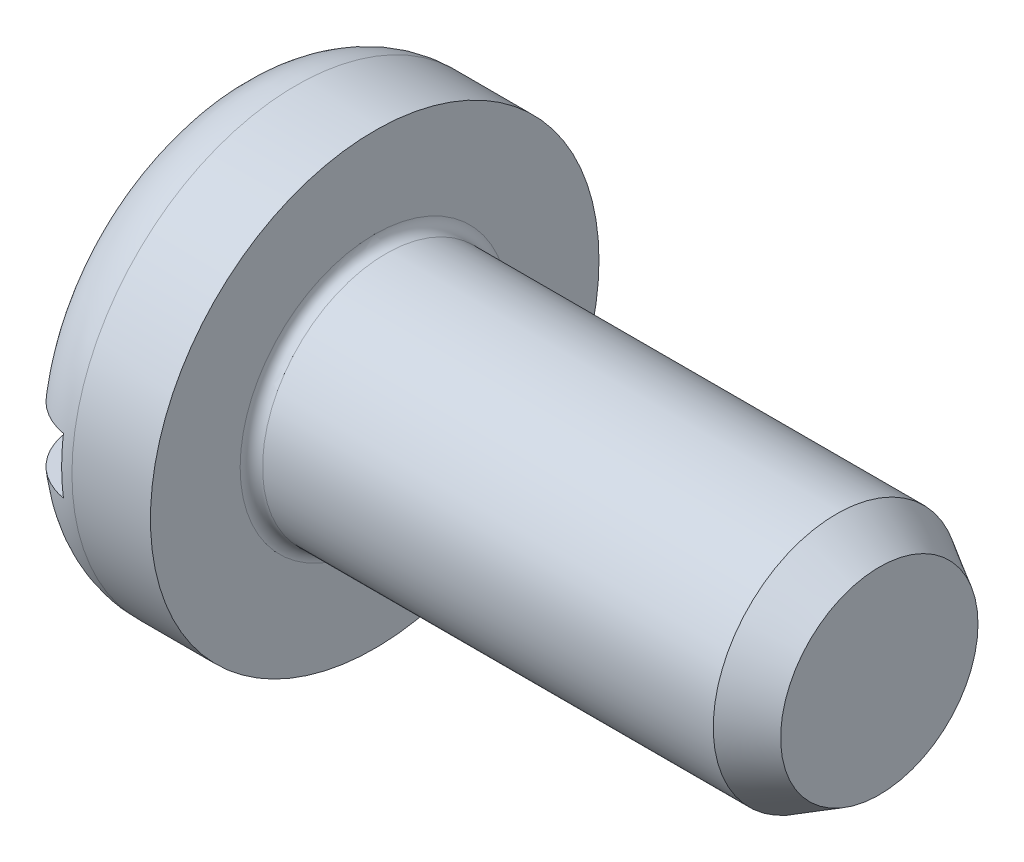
ISO-10303-21;
HEADER;
FILE_DESCRIPTION(('STEP AP214'),'2;1');
FILE_NAME('part.step','',(''),(''),'','','');
FILE_SCHEMA(('AUTOMOTIVE_DESIGN { 1 0 10303 214 1 1 1 1 }'));
ENDSEC;
DATA;
#1=APPLICATION_CONTEXT('core data for automotive mechanical design processes');
#2=APPLICATION_PROTOCOL_DEFINITION('international standard','automotive_design',2000,#1);
#3=PRODUCT_CONTEXT('',#1,'mechanical');
#4=PRODUCT('Part','Part','',(#3));
#5=PRODUCT_RELATED_PRODUCT_CATEGORY('part','',(#4));
#6=PRODUCT_DEFINITION_FORMATION('','',#4);
#7=PRODUCT_DEFINITION_CONTEXT('part definition',#1,'design');
#8=PRODUCT_DEFINITION('design','',#6,#7);
#9=PRODUCT_DEFINITION_SHAPE('','',#8);
#10=(LENGTH_UNIT() NAMED_UNIT(*) SI_UNIT(.MILLI.,.METRE.));
#11=(NAMED_UNIT(*) PLANE_ANGLE_UNIT() SI_UNIT($,.RADIAN.));
#12=(NAMED_UNIT(*) SI_UNIT($,.STERADIAN.) SOLID_ANGLE_UNIT());
#13=UNCERTAINTY_MEASURE_WITH_UNIT(LENGTH_MEASURE(1.E-05),#10,'distance_accuracy_value','');
#14=(GEOMETRIC_REPRESENTATION_CONTEXT(3) GLOBAL_UNCERTAINTY_ASSIGNED_CONTEXT((#13)) GLOBAL_UNIT_ASSIGNED_CONTEXT((#10,
#11,#12)) REPRESENTATION_CONTEXT('',''));
#15=CARTESIAN_POINT('',(0.,0.,0.));
#16=DIRECTION('',(0.,0.,1.));
#17=DIRECTION('',(1.,0.,0.));
#18=AXIS2_PLACEMENT_3D('',#15,#16,#17);
#19=CARTESIAN_POINT('',(0.,0.,0.));
#20=DIRECTION('',(-1.,0.,0.));
#21=DIRECTION('',(0.,0.,1.));
#22=AXIS2_PLACEMENT_3D('',#19,#20,#21);
#23=PLANE('',#22);
#24=DIRECTION('',(0.,0.,-1.));
#25=VECTOR('',#24,1.);
#26=CARTESIAN_POINT('',(0.,0.25,0.));
#27=LINE('',#26,#25);
#28=CARTESIAN_POINT('',(0.,0.25,1.37749773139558));
#29=VERTEX_POINT('',#28);
#30=CARTESIAN_POINT('',(0.,0.25,-1.37749773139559));
#31=VERTEX_POINT('',#30);
#32=EDGE_CURVE('E60',#29,#31,#27,.T.);
#33=ORIENTED_EDGE('',*,*,#32,.F.);
#34=CARTESIAN_POINT('',(0.,0.,0.));
#35=DIRECTION('',(-1.,0.,0.));
#36=DIRECTION('',(0.,0.,1.));
#37=AXIS2_PLACEMENT_3D('',#34,#35,#36);
#38=CIRCLE('',#37,1.4);
#39=EDGE_CURVE('E115',#29,#31,#38,.T.);
#40=ORIENTED_EDGE('',*,*,#39,.T.);
#41=EDGE_LOOP('',(#33,#40));
#42=FACE_BOUND('',#41,.T.);
#43=ADVANCED_FACE('F34',(#42),#23,.T.);
#44=CARTESIAN_POINT('',(5.8,1.1,0.));
#45=DIRECTION('',(1.,0.,0.));
#46=DIRECTION('',(0.,0.,-1.));
#47=AXIS2_PLACEMENT_3D('',#44,#45,#46);
#48=PLANE('',#47);
#49=CARTESIAN_POINT('',(5.8,0.,0.));
#50=DIRECTION('',(1.,0.,0.));
#51=DIRECTION('',(0.,0.,-1.));
#52=AXIS2_PLACEMENT_3D('',#49,#50,#51);
#53=CIRCLE('',#52,0.879999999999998);
#54=CARTESIAN_POINT('',(5.8,0.,-0.879999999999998));
#55=VERTEX_POINT('',#54);
#56=EDGE_CURVE('E138',#55,#55,#53,.T.);
#57=ORIENTED_EDGE('',*,*,#56,.T.);
#58=EDGE_LOOP('',(#57));
#59=FACE_BOUND('',#58,.T.);
#60=ADVANCED_FACE('F160',(#59),#48,.T.);
#61=CARTESIAN_POINT('',(13.1078858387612,0.,0.));
#62=DIRECTION('',(1.,0.,0.));
#63=DIRECTION('',(0.,0.,-1.));
#64=AXIS2_PLACEMENT_3D('',#61,#62,#63);
#65=CYLINDRICAL_SURFACE('',#64,1.1);
#66=CARTESIAN_POINT('',(1.4,0.,0.));
#67=DIRECTION('',(1.,0.,0.));
#68=DIRECTION('',(0.,0.,-1.));
#69=AXIS2_PLACEMENT_3D('',#66,#67,#68);
#70=CIRCLE('',#69,1.1);
#71=CARTESIAN_POINT('',(1.4,0.,-1.1));
#72=VERTEX_POINT('',#71);
#73=EDGE_CURVE('E130',#72,#72,#70,.T.);
#74=ORIENTED_EDGE('',*,*,#73,.T.);
#75=EDGE_LOOP('',(#74));
#76=FACE_BOUND('',#75,.T.);
#77=CARTESIAN_POINT('',(5.41894882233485,0.,0.));
#78=DIRECTION('',(1.,0.,0.));
#79=DIRECTION('',(0.,0.,-1.));
#80=AXIS2_PLACEMENT_3D('',#77,#78,#79);
#81=CIRCLE('',#80,1.1);
#82=CARTESIAN_POINT('',(5.41894882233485,0.,-1.1));
#83=VERTEX_POINT('',#82);
#84=EDGE_CURVE('E135',#83,#83,#81,.F.);
#85=ORIENTED_EDGE('',*,*,#84,.T.);
#86=EDGE_LOOP('',(#85));
#87=FACE_BOUND('',#86,.T.);
#88=ADVANCED_FACE('F156',(#76,#87),#65,.T.);
#89=CARTESIAN_POINT('',(1.3,2.,0.));
#90=DIRECTION('',(1.,0.,0.));
#91=DIRECTION('',(0.,0.,-1.));
#92=AXIS2_PLACEMENT_3D('',#89,#90,#91);
#93=PLANE('',#92);
#94=CARTESIAN_POINT('',(1.3,0.,0.));
#95=DIRECTION('',(1.,0.,0.));
#96=DIRECTION('',(0.,0.,-1.));
#97=AXIS2_PLACEMENT_3D('',#94,#95,#96);
#98=CIRCLE('',#97,1.2);
#99=CARTESIAN_POINT('',(1.3,0.,-1.2));
#100=VERTEX_POINT('',#99);
#101=EDGE_CURVE('E126',#100,#100,#98,.F.);
#102=ORIENTED_EDGE('',*,*,#101,.T.);
#103=EDGE_LOOP('',(#102));
#104=FACE_BOUND('',#103,.T.);
#105=CARTESIAN_POINT('',(1.3,0.,0.));
#106=DIRECTION('',(1.,0.,0.));
#107=DIRECTION('',(0.,0.,-1.));
#108=AXIS2_PLACEMENT_3D('',#105,#106,#107);
#109=CIRCLE('',#108,2.);
#110=CARTESIAN_POINT('',(1.3,0.,-2.));
#111=VERTEX_POINT('',#110);
#112=EDGE_CURVE('E141',#111,#111,#109,.T.);
#113=ORIENTED_EDGE('',*,*,#112,.T.);
#114=EDGE_LOOP('',(#113));
#115=FACE_BOUND('',#114,.T.);
#116=ADVANCED_FACE('F147',(#104,#115),#93,.T.);
#117=CARTESIAN_POINT('',(13.1078858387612,0.,0.));
#118=DIRECTION('',(1.,0.,0.));
#119=DIRECTION('',(0.,0.,-1.));
#120=AXIS2_PLACEMENT_3D('',#117,#118,#119);
#121=CYLINDRICAL_SURFACE('',#120,2.);
#122=CARTESIAN_POINT('',(0.6,0.,0.));
#123=DIRECTION('',(-1.,0.,0.));
#124=DIRECTION('',(0.,0.,1.));
#125=AXIS2_PLACEMENT_3D('',#122,#123,#124);
#126=CIRCLE('',#125,2.);
#127=CARTESIAN_POINT('',(0.6,0.,2.));
#128=VERTEX_POINT('',#127);
#129=EDGE_CURVE('E123',#128,#128,#126,.F.);
#130=ORIENTED_EDGE('',*,*,#129,.T.);
#131=EDGE_LOOP('',(#130));
#132=FACE_BOUND('',#131,.T.);
#133=ORIENTED_EDGE('',*,*,#112,.F.);
#134=EDGE_LOOP('',(#133));
#135=FACE_BOUND('',#134,.T.);
#136=ADVANCED_FACE('F149',(#132,#135),#121,.T.);
#137=DIRECTION('',(0.,0.,1.));
#138=VECTOR('',#137,1.);
#139=CARTESIAN_POINT('',(0.,-0.25,0.));
#140=LINE('',#139,#138);
#141=CARTESIAN_POINT('',(0.,-0.25,-1.37749773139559));
#142=VERTEX_POINT('',#141);
#143=CARTESIAN_POINT('',(0.,-0.25,1.37749773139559));
#144=VERTEX_POINT('',#143);
#145=EDGE_CURVE('E53',#142,#144,#140,.T.);
#146=ORIENTED_EDGE('',*,*,#145,.F.);
#147=EDGE_CURVE('E96',#142,#144,#38,.T.);
#148=ORIENTED_EDGE('',*,*,#147,.T.);
#149=EDGE_LOOP('',(#146,#148));
#150=FACE_BOUND('',#149,.T.);
#151=ADVANCED_FACE('F108',(#150),#23,.T.);
#152=CARTESIAN_POINT('',(5.8,0.,0.));
#153=DIRECTION('',(-1.,0.,0.));
#154=DIRECTION('',(0.,0.,1.));
#155=AXIS2_PLACEMENT_3D('',#152,#153,#154);
#156=CONICAL_SURFACE('',#155,0.879999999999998,0.523598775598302);
#157=ORIENTED_EDGE('',*,*,#84,.F.);
#158=EDGE_LOOP('',(#157));
#159=FACE_BOUND('',#158,.T.);
#160=ORIENTED_EDGE('',*,*,#56,.F.);
#161=EDGE_LOOP('',(#160));
#162=FACE_BOUND('',#161,.T.);
#163=ADVANCED_FACE('F155',(#159,#162),#156,.T.);
#164=CARTESIAN_POINT('',(1.4,0.,0.));
#165=DIRECTION('',(1.,0.,0.));
#166=DIRECTION('',(0.,0.,-1.));
#167=AXIS2_PLACEMENT_3D('',#164,#165,#166);
#168=TOROIDAL_SURFACE('',#167,1.2,0.1);
#169=ORIENTED_EDGE('',*,*,#101,.F.);
#170=EDGE_LOOP('',(#169));
#171=FACE_BOUND('',#170,.T.);
#172=ORIENTED_EDGE('',*,*,#73,.F.);
#173=EDGE_LOOP('',(#172));
#174=FACE_BOUND('',#173,.T.);
#175=ADVANCED_FACE('F173',(#171,#174),#168,.F.);
#176=CARTESIAN_POINT('',(0.6,0.,0.));
#177=DIRECTION('',(-1.,0.,0.));
#178=DIRECTION('',(0.,0.,1.));
#179=AXIS2_PLACEMENT_3D('',#176,#177,#178);
#180=TOROIDAL_SURFACE('',#179,1.4,0.6);
#181=CARTESIAN_POINT('',(0.274446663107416,0.25,-1.88751485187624));
#182=CARTESIAN_POINT('',(0.302521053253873,0.25,-1.9058058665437));
#183=CARTESIAN_POINT('',(0.33215460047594,0.25,-1.92174699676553));
#184=CARTESIAN_POINT('',(0.393700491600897,0.25,-1.94844353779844));
#185=CARTESIAN_POINT('',(0.425615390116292,0.25,-1.95919302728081));
#186=CARTESIAN_POINT('',(0.490790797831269,0.25,-1.97517084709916));
#187=CARTESIAN_POINT('',(0.524050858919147,0.25,-1.98040100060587));
#188=CARTESIAN_POINT('',(0.590968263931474,0.25,-1.98518928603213));
#189=CARTESIAN_POINT('',(0.6246255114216,0.25,-1.98474876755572));
#190=CARTESIAN_POINT('',(0.691325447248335,0.25,-1.9782186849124));
#191=CARTESIAN_POINT('',(0.7243691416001,0.25,-1.97213939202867));
#192=CARTESIAN_POINT('',(0.788969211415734,0.25,-1.95452411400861));
#193=CARTESIAN_POINT('',(0.820525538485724,0.25,-1.94298795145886));
#194=CARTESIAN_POINT('',(0.881288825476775,0.25,-1.91478263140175));
#195=CARTESIAN_POINT('',(0.910493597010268,0.25,-1.89810876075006));
#196=CARTESIAN_POINT('',(0.9657060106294,0.25,-1.86011629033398));
#197=CARTESIAN_POINT('',(0.991713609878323,0.25,-1.83879762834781));
#198=CARTESIAN_POINT('',(1.03993069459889,0.25,-1.79201907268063));
#199=CARTESIAN_POINT('',(1.06212166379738,0.25,-1.76654009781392));
#200=CARTESIAN_POINT('',(1.10195361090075,0.25,-1.7122455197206));
#201=CARTESIAN_POINT('',(1.1195944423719,0.25,-1.68342980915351));
#202=CARTESIAN_POINT('',(1.14999499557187,0.25,-1.6230180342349));
#203=CARTESIAN_POINT('',(1.16271134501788,0.25,-1.59140015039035));
#204=CARTESIAN_POINT('',(1.18272657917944,0.25,-1.52649488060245));
#205=CARTESIAN_POINT('',(1.19002515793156,0.25,-1.49320740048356));
#206=CARTESIAN_POINT('',(1.19909884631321,0.25,-1.42547106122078));
#207=CARTESIAN_POINT('',(1.20080483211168,0.25,-1.39101294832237));
#208=CARTESIAN_POINT('',(1.19849411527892,0.25,-1.32228972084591));
#209=CARTESIAN_POINT('',(1.19447696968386,0.25,-1.28802462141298));
#210=CARTESIAN_POINT('',(1.18076791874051,0.25,-1.22013715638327));
#211=CARTESIAN_POINT('',(1.17099548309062,0.25,-1.18653104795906));
#212=CARTESIAN_POINT('',(1.14600810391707,0.25,-1.12140538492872));
#213=CARTESIAN_POINT('',(1.13079264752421,0.25,-1.08988602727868));
#214=CARTESIAN_POINT('',(1.09515290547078,0.25,-1.02948947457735));
#215=CARTESIAN_POINT('',(1.07467518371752,0.25,-1.00064378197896));
#216=CARTESIAN_POINT('',(1.02914168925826,0.25,-0.946817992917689));
#217=CARTESIAN_POINT('',(1.00408565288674,0.25,-0.921838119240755));
#218=CARTESIAN_POINT('',(0.950223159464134,0.25,-0.876669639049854));
#219=CARTESIAN_POINT('',(0.921439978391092,0.25,-0.85645332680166));
#220=CARTESIAN_POINT('',(0.860791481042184,0.25,-0.821340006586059));
#221=CARTESIAN_POINT('',(0.828926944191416,0.25,-0.806441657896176));
#222=CARTESIAN_POINT('',(0.764188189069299,0.25,-0.782986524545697));
#223=CARTESIAN_POINT('',(0.731387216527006,0.25,-0.774227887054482));
#224=CARTESIAN_POINT('',(0.664759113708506,0.25,-0.762621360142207));
#225=CARTESIAN_POINT('',(0.630932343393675,0.25,-0.759771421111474));
#226=CARTESIAN_POINT('',(0.564762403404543,0.25,-0.760104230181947));
#227=CARTESIAN_POINT('',(0.532417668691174,0.25,-0.763034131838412));
#228=CARTESIAN_POINT('',(0.468685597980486,0.25,-0.774297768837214));
#229=CARTESIAN_POINT('',(0.437298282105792,0.25,-0.782631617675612));
#230=CARTESIAN_POINT('',(0.37639068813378,0.25,-0.80434783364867));
#231=CARTESIAN_POINT('',(0.346867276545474,0.25,-0.817721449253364));
#232=CARTESIAN_POINT('',(0.290360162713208,0.25,-0.84904601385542));
#233=CARTESIAN_POINT('',(0.263376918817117,0.25,-0.866997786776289));
#234=CARTESIAN_POINT('',(0.211549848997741,0.25,-0.907739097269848));
#235=CARTESIAN_POINT('',(0.186836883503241,0.25,-0.930695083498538));
#236=CARTESIAN_POINT('',(0.141440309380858,0.25,-0.980295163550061));
#237=CARTESIAN_POINT('',(0.120757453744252,0.25,-1.00693994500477));
#238=CARTESIAN_POINT('',(0.0832351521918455,0.25,-1.06425685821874));
#239=CARTESIAN_POINT('',(0.0665688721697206,0.25,-1.09504252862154));
#240=CARTESIAN_POINT('',(0.0385748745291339,0.25,-1.15895379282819));
#241=CARTESIAN_POINT('',(0.0272475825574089,0.25,-1.19207957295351));
#242=CARTESIAN_POINT('',(0.0101728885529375,0.25,-1.2601285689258));
#243=CARTESIAN_POINT('',(0.00448792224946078,0.25,-1.29506749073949));
#244=CARTESIAN_POINT('',(-0.000882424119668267,0.25,-1.36540339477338));
#245=CARTESIAN_POINT('',(-0.000568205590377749,0.25,-1.40080034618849));
#246=CARTESIAN_POINT('',(0.00606540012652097,0.25,-1.47072452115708));
#247=CARTESIAN_POINT('',(0.0123337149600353,0.25,-1.50525658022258));
#248=CARTESIAN_POINT('',(0.0306671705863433,0.25,-1.57275717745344));
#249=CARTESIAN_POINT('',(0.042733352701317,0.25,-1.60572543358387));
#250=CARTESIAN_POINT('',(0.0721364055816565,0.25,-1.66865972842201));
#251=CARTESIAN_POINT('',(0.0893977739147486,0.25,-1.69866109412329));
#252=CARTESIAN_POINT('',(0.128764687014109,0.25,-1.75525974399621));
#253=CARTESIAN_POINT('',(0.150863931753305,0.25,-1.78186138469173));
#254=CARTESIAN_POINT('',(0.190112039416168,0.25,-1.82161520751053));
#255=CARTESIAN_POINT('',(0.205980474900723,0.25,-1.83605370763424));
#256=CARTESIAN_POINT('',(0.239168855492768,0.25,-1.86315357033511));
#257=CARTESIAN_POINT('',(0.256488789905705,0.25,-1.87581494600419));
#258=CARTESIAN_POINT('',(0.274446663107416,0.25,-1.88751485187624));
#259=B_SPLINE_CURVE_WITH_KNOTS('',3,(#181,#182,#183,#184,#185,#186,#187,#188,#189,#190,#191,
#192,#193,#194,#195,#196,#197,#198,#199,#200,#201,#202,#203,#204,#205,#206,#207,#208,#209,#210,
#211,#212,#213,#214,#215,#216,#217,#218,#219,#220,#221,#222,#223,#224,#225,#226,#227,#228,#229,
#230,#231,#232,#233,#234,#235,#236,#237,#238,#239,#240,#241,#242,#243,#244,#245,#246,#247,#248,
#249,#250,#251,#252,#253,#254,#255,#256,#257,#258),.UNSPECIFIED.,.T.,.F.,(4,2,2,2,2,2,2,2,2,2,2,
2,2,2,2,2,2,2,2,2,2,2,2,2,2,2,2,2,2,2,2,2,2,2,2,2,2,2,4),(0.,0.10044373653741,0.201001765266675,
0.301526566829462,0.402027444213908,0.502345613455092,0.602667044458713,0.703080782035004,
0.8034958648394,0.904385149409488,1.00527768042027,1.10703963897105,1.20880734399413,
1.31182823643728,1.41485710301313,1.51936303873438,1.6238788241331,1.72950102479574,
1.83512931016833,1.9401271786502,2.04509855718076,2.14643257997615,2.24773144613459,
2.34469702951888,2.44166464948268,2.53846465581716,2.63528209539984,2.73601962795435,
2.836775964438,2.94130978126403,3.04585193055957,3.15153841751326,3.25721783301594,
3.3619988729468,3.4667987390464,3.57014359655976,3.67335466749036,3.73760429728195,
3.80185345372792),.UNSPECIFIED.);
#260=CARTESIAN_POINT('',(0.5,0.25,-1.97585483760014));
#261=VERTEX_POINT('',#260);
#262=EDGE_CURVE('E11',#31,#261,#259,.T.);
#263=ORIENTED_EDGE('',*,*,#262,.F.);
#264=ORIENTED_EDGE('',*,*,#39,.F.);
#265=CARTESIAN_POINT('',(0.274188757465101,0.25,0.860590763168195));
#266=CARTESIAN_POINT('',(0.301474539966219,0.25,0.8422177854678));
#267=CARTESIAN_POINT('',(0.330273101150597,0.25,0.826059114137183));
#268=CARTESIAN_POINT('',(0.390172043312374,0.25,0.798735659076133));
#269=CARTESIAN_POINT('',(0.421273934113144,0.25,0.787574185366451));
#270=CARTESIAN_POINT('',(0.484970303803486,0.25,0.770683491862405));
#271=CARTESIAN_POINT('',(0.517566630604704,0.25,0.764961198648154));
#272=CARTESIAN_POINT('',(0.583250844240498,0.25,0.759228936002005));
#273=CARTESIAN_POINT('',(0.616338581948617,0.25,0.759217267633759));
#274=CARTESIAN_POINT('',(0.681233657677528,0.25,0.764833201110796));
#275=CARTESIAN_POINT('',(0.713052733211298,0.25,0.770326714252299));
#276=CARTESIAN_POINT('',(0.775335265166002,0.25,0.786521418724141));
#277=CARTESIAN_POINT('',(0.805798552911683,0.25,0.797223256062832));
#278=CARTESIAN_POINT('',(0.864902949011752,0.25,0.823576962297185));
#279=CARTESIAN_POINT('',(0.89352008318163,0.25,0.83928244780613));
#280=CARTESIAN_POINT('',(0.947863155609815,0.25,0.875079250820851));
#281=CARTESIAN_POINT('',(0.973588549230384,0.25,0.895171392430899));
#282=CARTESIAN_POINT('',(1.02260785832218,0.25,0.940122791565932));
#283=CARTESIAN_POINT('',(1.04574542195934,0.25,0.965152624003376));
#284=CARTESIAN_POINT('',(1.08765047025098,0.25,1.01863696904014));
#285=CARTESIAN_POINT('',(1.10641722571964,0.25,1.04709205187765));
#286=CARTESIAN_POINT('',(1.13962700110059,0.25,1.10761472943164));
#287=CARTESIAN_POINT('',(1.15391313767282,0.25,1.13976856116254));
#288=CARTESIAN_POINT('',(1.17691746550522,0.25,1.206011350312));
#289=CARTESIAN_POINT('',(1.18563538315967,0.25,1.24010040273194));
#290=CARTESIAN_POINT('',(1.19725856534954,0.25,1.30943782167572));
#291=CARTESIAN_POINT('',(1.20013386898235,0.25,1.34469122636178));
#292=CARTESIAN_POINT('',(1.19985655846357,0.25,1.41517552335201));
#293=CARTESIAN_POINT('',(1.19670421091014,0.25,1.45040641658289));
#294=CARTESIAN_POINT('',(1.18448589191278,0.25,1.51943456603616));
#295=CARTESIAN_POINT('',(1.17548437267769,0.25,1.55324322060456));
#296=CARTESIAN_POINT('',(1.15184957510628,0.25,1.6188319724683));
#297=CARTESIAN_POINT('',(1.1372167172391,0.25,1.65061222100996));
#298=CARTESIAN_POINT('',(1.10296526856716,0.25,1.71075309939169));
#299=CARTESIAN_POINT('',(1.08342180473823,0.25,1.73915651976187));
#300=CARTESIAN_POINT('',(1.03978895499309,0.25,1.79222635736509));
#301=CARTESIAN_POINT('',(1.01569987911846,0.25,1.81689302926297));
#302=CARTESIAN_POINT('',(0.96397994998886,0.25,1.86147494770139));
#303=CARTESIAN_POINT('',(0.936395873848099,0.25,1.88144447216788));
#304=CARTESIAN_POINT('',(0.878243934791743,0.25,1.91642327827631));
#305=CARTESIAN_POINT('',(0.847676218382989,0.25,1.93143280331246));
#306=CARTESIAN_POINT('',(0.784699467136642,0.25,1.95594147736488));
#307=CARTESIAN_POINT('',(0.752307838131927,0.25,1.96548536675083));
#308=CARTESIAN_POINT('',(0.686379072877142,0.25,1.97897323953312));
#309=CARTESIAN_POINT('',(0.652841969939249,0.25,1.98291738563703));
#310=CARTESIAN_POINT('',(0.585728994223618,0.25,1.98508464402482));
#311=CARTESIAN_POINT('',(0.552153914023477,0.25,1.9833323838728));
#312=CARTESIAN_POINT('',(0.485775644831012,0.25,1.97421254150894));
#313=CARTESIAN_POINT('',(0.452972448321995,0.25,1.96684501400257));
#314=CARTESIAN_POINT('',(0.38908394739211,0.25,1.94671576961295));
#315=CARTESIAN_POINT('',(0.357997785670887,0.25,1.93395677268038));
#316=CARTESIAN_POINT('',(0.298399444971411,0.25,1.9034171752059));
#317=CARTESIAN_POINT('',(0.269887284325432,0.25,1.88563653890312));
#318=CARTESIAN_POINT('',(0.216141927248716,0.25,1.84550317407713));
#319=CARTESIAN_POINT('',(0.190919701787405,0.25,1.82313575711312));
#320=CARTESIAN_POINT('',(0.144556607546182,0.25,1.77451068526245));
#321=CARTESIAN_POINT('',(0.123415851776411,0.25,1.74825292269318));
#322=CARTESIAN_POINT('',(0.0856483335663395,0.25,1.69239770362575));
#323=CARTESIAN_POINT('',(0.0690547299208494,0.25,1.66277783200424));
#324=CARTESIAN_POINT('',(0.0410151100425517,0.25,1.60119541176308));
#325=CARTESIAN_POINT('',(0.0295693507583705,0.25,1.56923274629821));
#326=CARTESIAN_POINT('',(0.0120095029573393,0.25,1.50349888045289));
#327=CARTESIAN_POINT('',(0.00595539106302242,0.25,1.46971166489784));
#328=CARTESIAN_POINT('',(-0.000477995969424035,0.25,1.40160338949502));
#329=CARTESIAN_POINT('',(-0.000857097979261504,0.25,1.36728231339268));
#330=CARTESIAN_POINT('',(0.00406316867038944,0.25,1.29857235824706));
#331=CARTESIAN_POINT('',(0.0094412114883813,0.25,1.2641891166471));
#332=CARTESIAN_POINT('',(0.0258177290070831,0.25,1.19677853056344));
#333=CARTESIAN_POINT('',(0.0368180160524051,0.25,1.16375162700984));
#334=CARTESIAN_POINT('',(0.064301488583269,0.25,1.09953382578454));
#335=CARTESIAN_POINT('',(0.0808570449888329,0.25,1.06837392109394));
#336=CARTESIAN_POINT('',(0.118941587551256,0.25,1.00928774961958));
#337=CARTESIAN_POINT('',(0.140465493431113,0.25,0.981358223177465));
#338=CARTESIAN_POINT('',(0.180564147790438,0.25,0.937550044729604));
#339=CARTESIAN_POINT('',(0.197997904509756,0.25,0.920612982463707));
#340=CARTESIAN_POINT('',(0.234742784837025,0.25,0.888912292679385));
#341=CARTESIAN_POINT('',(0.254053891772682,0.25,0.874148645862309));
#342=CARTESIAN_POINT('',(0.274188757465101,0.25,0.860590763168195));
#343=B_SPLINE_CURVE_WITH_KNOTS('',3,(#265,#266,#267,#268,#269,#270,#271,#272,#273,#274,#275,
#276,#277,#278,#279,#280,#281,#282,#283,#284,#285,#286,#287,#288,#289,#290,#291,#292,#293,#294,
#295,#296,#297,#298,#299,#300,#301,#302,#303,#304,#305,#306,#307,#308,#309,#310,#311,#312,#313,
#314,#315,#316,#317,#318,#319,#320,#321,#322,#323,#324,#325,#326,#327,#328,#329,#330,#331,#332,
#333,#334,#335,#336,#337,#338,#339,#340,#341,#342),.UNSPECIFIED.,.T.,.F.,(4,2,2,2,2,2,2,2,2,2,2,
2,2,2,2,2,2,2,2,2,2,2,2,2,2,2,2,2,2,2,2,2,2,2,2,2,2,2,4),(0.,0.0986016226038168,
0.197268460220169,0.296060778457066,0.394823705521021,0.491238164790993,0.587664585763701,
0.685161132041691,0.782676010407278,0.884472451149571,0.986285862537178,1.09134452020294,
1.19640833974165,1.30200958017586,1.40760615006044,1.5120584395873,1.61650293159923,
1.71943766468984,1.82236537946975,1.92403782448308,2.02570527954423,2.12652815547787,
2.22734810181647,2.32773274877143,2.42811641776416,2.52844950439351,2.62878330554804,
2.72944357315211,2.83010662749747,2.93148530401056,3.03286904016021,3.13536696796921,
3.23786802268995,3.34178789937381,3.44574129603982,3.5511052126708,3.65636186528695,
3.72912313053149,3.80188374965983),.UNSPECIFIED.);
#344=CARTESIAN_POINT('',(0.5,0.25,1.97585483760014));
#345=VERTEX_POINT('',#344);
#346=EDGE_CURVE('E97',#345,#29,#343,.T.);
#347=ORIENTED_EDGE('',*,*,#346,.F.);
#348=CARTESIAN_POINT('',(0.5,0.,0.));
#349=DIRECTION('',(1.,0.,0.));
#350=DIRECTION('',(0.,1.,0.));
#351=AXIS2_PLACEMENT_3D('',#348,#349,#350);
#352=CIRCLE('',#351,1.99160797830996);
#353=CARTESIAN_POINT('',(0.5,-0.25,1.97585483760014));
#354=VERTEX_POINT('',#353);
#355=EDGE_CURVE('E89',#354,#345,#352,.F.);
#356=ORIENTED_EDGE('',*,*,#355,.F.);
#357=CARTESIAN_POINT('',(0.274188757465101,-0.25,0.860590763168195));
#358=CARTESIAN_POINT('',(0.245293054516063,-0.25,0.880050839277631));
#359=CARTESIAN_POINT('',(0.218052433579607,-0.25,0.902023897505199));
#360=CARTESIAN_POINT('',(0.167631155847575,-0.25,0.95026556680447));
#361=CARTESIAN_POINT('',(0.144457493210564,-0.25,0.9765414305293));
#362=CARTESIAN_POINT('',(0.102838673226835,-0.25,1.03254910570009));
#363=CARTESIAN_POINT('',(0.0843869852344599,-0.25,1.06227606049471));
#364=CARTESIAN_POINT('',(0.0526746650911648,-0.25,1.1243649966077));
#365=CARTESIAN_POINT('',(0.0394121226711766,-0.25,1.15672600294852));
#366=CARTESIAN_POINT('',(0.018320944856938,-0.25,1.22359548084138));
#367=CARTESIAN_POINT('',(0.0105581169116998,-0.25,1.25812474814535));
#368=CARTESIAN_POINT('',(0.000976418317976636,-0.25,1.32800242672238));
#369=CARTESIAN_POINT('',(-0.000842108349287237,-0.25,1.3633508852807));
#370=CARTESIAN_POINT('',(0.00155370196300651,-0.25,1.43362976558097));
#371=CARTESIAN_POINT('',(0.00573151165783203,-0.25,1.46856142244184));
#372=CARTESIAN_POINT('',(0.0199781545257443,-0.25,1.53720281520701));
#373=CARTESIAN_POINT('',(0.0300465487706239,-0.25,1.57091264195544));
#374=CARTESIAN_POINT('',(0.0556372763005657,-0.25,1.63564743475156));
#375=CARTESIAN_POINT('',(0.0710810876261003,-0.25,1.66670344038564));
#376=CARTESIAN_POINT('',(0.107032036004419,-0.25,1.72573226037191));
#377=CARTESIAN_POINT('',(0.127538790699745,-0.25,1.75370530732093));
#378=CARTESIAN_POINT('',(0.172731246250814,-0.25,1.80537649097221));
#379=CARTESIAN_POINT('',(0.19735684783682,-0.25,1.8291272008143));
#380=CARTESIAN_POINT('',(0.250280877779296,-0.25,1.87210643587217));
#381=CARTESIAN_POINT('',(0.278579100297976,-0.25,1.89133521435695));
#382=CARTESIAN_POINT('',(0.337738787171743,-0.25,1.92452859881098));
#383=CARTESIAN_POINT('',(0.368571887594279,-0.25,1.93854377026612));
#384=CARTESIAN_POINT('',(0.432162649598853,-0.25,1.96116348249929));
#385=CARTESIAN_POINT('',(0.464920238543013,-0.25,1.96976822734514));
#386=CARTESIAN_POINT('',(0.531220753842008,-0.25,1.98127744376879));
#387=CARTESIAN_POINT('',(0.564757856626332,-0.25,1.98421548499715));
#388=CARTESIAN_POINT('',(0.631847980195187,-0.25,1.98440664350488));
#389=CARTESIAN_POINT('',(0.665401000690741,-0.25,1.98165986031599));
#390=CARTESIAN_POINT('',(0.731498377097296,-0.25,1.97057388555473));
#391=CARTESIAN_POINT('',(0.764044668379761,-0.25,1.96224622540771));
#392=CARTESIAN_POINT('',(0.827280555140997,-0.25,1.94025394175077));
#393=CARTESIAN_POINT('',(0.857970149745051,-0.25,1.92658931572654));
#394=CARTESIAN_POINT('',(0.916681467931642,-0.25,1.89429343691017));
#395=CARTESIAN_POINT('',(0.944698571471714,-0.25,1.87565378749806));
#396=CARTESIAN_POINT('',(0.997227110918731,-0.25,1.83395925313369));
#397=CARTESIAN_POINT('',(1.02173848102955,-0.25,1.81090428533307));
#398=CARTESIAN_POINT('',(1.06671027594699,-0.25,1.76090348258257));
#399=CARTESIAN_POINT('',(1.08714765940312,-0.25,1.7339369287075));
#400=CARTESIAN_POINT('',(1.12325356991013,-0.25,1.67698194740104));
#401=CARTESIAN_POINT('',(1.13892191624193,-0.25,1.64699340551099));
#402=CARTESIAN_POINT('',(1.16520961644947,-0.25,1.58454738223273));
#403=CARTESIAN_POINT('',(1.17578008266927,-0.25,1.55206932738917));
#404=CARTESIAN_POINT('',(1.1913945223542,-0.25,1.48581189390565));
#405=CARTESIAN_POINT('',(1.19643816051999,-0.25,1.4520324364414));
#406=CARTESIAN_POINT('',(1.20092952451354,-0.25,1.38366471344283));
#407=CARTESIAN_POINT('',(1.20030396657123,-0.25,1.34907163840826));
#408=CARTESIAN_POINT('',(1.19333975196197,-0.25,1.28046580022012));
#409=CARTESIAN_POINT('',(1.18700063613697,-0.25,1.2464530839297));
#410=CARTESIAN_POINT('',(1.16868481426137,-0.25,1.17945927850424));
#411=CARTESIAN_POINT('',(1.15662911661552,-0.25,1.14649977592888));
#412=CARTESIAN_POINT('',(1.1272032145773,-0.25,1.08304257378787));
#413=CARTESIAN_POINT('',(1.10983248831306,-0.25,1.05254511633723));
#414=CARTESIAN_POINT('',(1.07008075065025,-0.25,0.99462499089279));
#415=CARTESIAN_POINT('',(1.04765845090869,-0.25,0.967230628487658));
#416=CARTESIAN_POINT('',(0.998485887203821,-0.25,0.916640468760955));
#417=CARTESIAN_POINT('',(0.971735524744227,-0.25,0.893444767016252));
#418=CARTESIAN_POINT('',(0.914946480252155,-0.25,0.852254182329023));
#419=CARTESIAN_POINT('',(0.884948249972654,-0.25,0.834203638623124));
#420=CARTESIAN_POINT('',(0.822255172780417,-0.25,0.803635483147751));
#421=CARTESIAN_POINT('',(0.78956131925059,-0.25,0.791115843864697));
#422=CARTESIAN_POINT('',(0.723789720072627,-0.25,0.772521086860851));
#423=CARTESIAN_POINT('',(0.690778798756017,-0.25,0.766209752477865));
#424=CARTESIAN_POINT('',(0.624155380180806,-0.25,0.75946523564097));
#425=CARTESIAN_POINT('',(0.590542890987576,-0.25,0.759031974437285));
#426=CARTESIAN_POINT('',(0.525027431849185,-0.25,0.763966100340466));
#427=CARTESIAN_POINT('',(0.493107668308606,-0.25,0.769116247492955));
#428=CARTESIAN_POINT('',(0.430600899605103,-0.25,0.784655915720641));
#429=CARTESIAN_POINT('',(0.400012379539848,-0.25,0.795039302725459));
#430=CARTESIAN_POINT('',(0.35367369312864,-0.25,0.815117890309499));
#431=CARTESIAN_POINT('',(0.33719914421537,-0.25,0.823188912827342));
#432=CARTESIAN_POINT('',(0.305059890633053,-0.25,0.840804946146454));
#433=CARTESIAN_POINT('',(0.289395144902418,-0.25,0.850349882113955));
#434=CARTESIAN_POINT('',(0.274188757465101,-0.25,0.860590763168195));
#435=B_SPLINE_CURVE_WITH_KNOTS('',3,(#357,#358,#359,#360,#361,#362,#363,#364,#365,#366,#367,
#368,#369,#370,#371,#372,#373,#374,#375,#376,#377,#378,#379,#380,#381,#382,#383,#384,#385,#386,
#387,#388,#389,#390,#391,#392,#393,#394,#395,#396,#397,#398,#399,#400,#401,#402,#403,#404,#405,
#406,#407,#408,#409,#410,#411,#412,#413,#414,#415,#416,#417,#418,#419,#420,#421,#422,#423,#424,
#425,#426,#427,#428,#429,#430,#431,#432,#433,#434),.UNSPECIFIED.,.T.,.F.,(4,2,2,2,2,2,2,2,2,2,2,
2,2,2,2,2,2,2,2,2,2,2,2,2,2,2,2,2,2,2,2,2,2,2,2,2,2,2,4),(0.,0.104443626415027,
0.209065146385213,0.313541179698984,0.417978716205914,0.523645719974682,0.629318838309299,
0.734350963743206,0.839375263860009,0.942925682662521,1.04646828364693,1.14861423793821,
1.25075446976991,1.35187650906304,1.45299473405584,1.55351207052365,1.65402764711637,
1.75433617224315,1.85464474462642,1.95512369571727,2.05560453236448,2.15663847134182,
2.25767623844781,2.35966456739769,2.46165908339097,2.56497390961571,2.6682970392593,
2.77309144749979,2.87789614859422,2.98359071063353,3.08928767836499,3.19379358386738,
3.29826114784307,3.3985794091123,3.49889632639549,3.59544570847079,3.691882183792,
3.74684851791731,3.80181206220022),.UNSPECIFIED.);
#436=EDGE_CURVE('E91',#144,#354,#435,.T.);
#437=ORIENTED_EDGE('',*,*,#436,.F.);
#438=ORIENTED_EDGE('',*,*,#147,.F.);
#439=CARTESIAN_POINT('',(0.274446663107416,-0.25,-1.88751485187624));
#440=CARTESIAN_POINT('',(0.246091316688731,-0.25,-1.86903712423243));
#441=CARTESIAN_POINT('',(0.219284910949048,-0.25,-1.84813447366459));
#442=CARTESIAN_POINT('',(0.169551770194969,-0.25,-1.80209585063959));
#443=CARTESIAN_POINT('',(0.146630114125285,-0.25,-1.77695442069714));
#444=CARTESIAN_POINT('',(0.105343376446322,-0.25,-1.72320735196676));
#445=CARTESIAN_POINT('',(0.0869742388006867,-0.25,-1.69460483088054));
#446=CARTESIAN_POINT('',(0.0552627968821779,-0.25,-1.63474965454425));
#447=CARTESIAN_POINT('',(0.0419192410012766,-0.25,-1.60349766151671));
#448=CARTESIAN_POINT('',(0.0205039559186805,-0.25,-1.53896682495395));
#449=CARTESIAN_POINT('',(0.0124741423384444,-0.25,-1.50567407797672));
#450=CARTESIAN_POINT('',(0.0020365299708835,-0.25,-1.43821821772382));
#451=CARTESIAN_POINT('',(-0.00037067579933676,-0.25,-1.40405501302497));
#452=CARTESIAN_POINT('',(0.000468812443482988,-0.25,-1.33533493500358));
#453=CARTESIAN_POINT('',(0.00379263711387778,-0.25,-1.30077900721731));
#454=CARTESIAN_POINT('',(0.0161122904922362,-0.25,-1.23269349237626));
#455=CARTESIAN_POINT('',(0.0251085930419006,-0.25,-1.19916399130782));
#456=CARTESIAN_POINT('',(0.0486629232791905,-0.25,-1.13359517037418));
#457=CARTESIAN_POINT('',(0.0632958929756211,-0.25,-1.10158275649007));
#458=CARTESIAN_POINT('',(0.0976990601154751,-0.25,-1.04044498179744));
#459=CARTESIAN_POINT('',(0.117469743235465,-0.25,-1.01131989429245));
#460=CARTESIAN_POINT('',(0.161736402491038,-0.25,-0.956650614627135));
#461=CARTESIAN_POINT('',(0.186256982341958,-0.25,-0.931126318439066));
#462=CARTESIAN_POINT('',(0.239304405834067,-0.25,-0.884641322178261));
#463=CARTESIAN_POINT('',(0.267831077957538,-0.25,-0.86368042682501));
#464=CARTESIAN_POINT('',(0.327567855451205,-0.25,-0.82738976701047));
#465=CARTESIAN_POINT('',(0.358720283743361,-0.25,-0.811965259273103));
#466=CARTESIAN_POINT('',(0.423252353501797,-0.25,-0.786840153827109));
#467=CARTESIAN_POINT('',(0.456631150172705,-0.25,-0.77713739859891));
#468=CARTESIAN_POINT('',(0.523103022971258,-0.25,-0.764178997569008));
#469=CARTESIAN_POINT('',(0.556144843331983,-0.25,-0.760660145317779));
#470=CARTESIAN_POINT('',(0.622334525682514,-0.25,-0.759411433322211));
#471=CARTESIAN_POINT('',(0.655482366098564,-0.25,-0.761680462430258));
#472=CARTESIAN_POINT('',(0.719907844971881,-0.25,-0.771747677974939));
#473=CARTESIAN_POINT('',(0.751211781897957,-0.25,-0.779379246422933));
#474=CARTESIAN_POINT('',(0.812137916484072,-0.25,-0.799682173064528));
#475=CARTESIAN_POINT('',(0.841759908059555,-0.25,-0.812354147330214));
#476=CARTESIAN_POINT('',(0.899176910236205,-0.25,-0.842602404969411));
#477=CARTESIAN_POINT('',(0.926920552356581,-0.25,-0.860276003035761));
#478=CARTESIAN_POINT('',(0.979215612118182,-0.25,-0.899840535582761));
#479=CARTESIAN_POINT('',(1.00376639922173,-0.25,-0.921732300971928));
#480=CARTESIAN_POINT('',(1.05011829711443,-0.25,-0.970173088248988));
#481=CARTESIAN_POINT('',(1.07174804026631,-0.25,-0.996886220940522));
#482=CARTESIAN_POINT('',(1.11035670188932,-0.25,-1.05348606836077));
#483=CARTESIAN_POINT('',(1.12733493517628,-0.25,-1.08337324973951));
#484=CARTESIAN_POINT('',(1.15657717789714,-0.25,-1.14634042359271));
#485=CARTESIAN_POINT('',(1.16870464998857,-0.25,-1.17948394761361));
#486=CARTESIAN_POINT('',(1.18722910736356,-0.25,-1.24733695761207));
#487=CARTESIAN_POINT('',(1.19362594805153,-0.25,-1.28204648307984));
#488=CARTESIAN_POINT('',(1.20047451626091,-0.25,-1.35207449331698));
#489=CARTESIAN_POINT('',(1.20092204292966,-0.25,-1.38739339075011));
#490=CARTESIAN_POINT('',(1.19580341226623,-0.25,-1.45759379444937));
#491=CARTESIAN_POINT('',(1.19023759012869,-0.25,-1.49247532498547));
#492=CARTESIAN_POINT('',(1.17331702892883,-0.25,-1.56034751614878));
#493=CARTESIAN_POINT('',(1.16203469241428,-0.25,-1.59335621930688));
#494=CARTESIAN_POINT('',(1.13400890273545,-0.25,-1.65696845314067));
#495=CARTESIAN_POINT('',(1.11726585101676,-0.25,-1.68757216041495));
#496=CARTESIAN_POINT('',(1.07905530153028,-0.25,-1.74504167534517));
#497=CARTESIAN_POINT('',(1.05765871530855,-0.25,-1.77195463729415));
#498=CARTESIAN_POINT('',(1.01060310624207,-0.25,-1.82175352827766));
#499=CARTESIAN_POINT('',(0.984944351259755,-0.25,-1.84463971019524));
#500=CARTESIAN_POINT('',(0.930412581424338,-0.25,-1.88546324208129));
#501=CARTESIAN_POINT('',(0.901579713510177,-0.25,-1.90345423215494));
#502=CARTESIAN_POINT('',(0.841286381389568,-0.25,-1.93429688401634));
#503=CARTESIAN_POINT('',(0.809826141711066,-0.25,-1.94714898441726));
#504=CARTESIAN_POINT('',(0.745428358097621,-0.25,-1.96725554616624));
#505=CARTESIAN_POINT('',(0.712503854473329,-0.25,-1.97455179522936));
#506=CARTESIAN_POINT('',(0.645886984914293,-0.25,-1.9834928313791));
#507=CARTESIAN_POINT('',(0.612194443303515,-0.25,-1.9851363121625));
#508=CARTESIAN_POINT('',(0.545120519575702,-0.25,-1.98272524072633));
#509=CARTESIAN_POINT('',(0.511738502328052,-0.25,-1.97868802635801));
#510=CARTESIAN_POINT('',(0.446156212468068,-0.25,-1.96506601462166));
#511=CARTESIAN_POINT('',(0.413954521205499,-0.25,-1.95548812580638));
#512=CARTESIAN_POINT('',(0.363851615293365,-0.25,-1.93587405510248));
#513=CARTESIAN_POINT('',(0.34528797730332,-0.25,-1.92748574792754));
#514=CARTESIAN_POINT('',(0.309111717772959,-0.25,-1.90886224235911));
#515=CARTESIAN_POINT('',(0.291499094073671,-0.25,-1.89862704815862));
#516=CARTESIAN_POINT('',(0.274446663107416,-0.25,-1.88751485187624));
#517=B_SPLINE_CURVE_WITH_KNOTS('',3,(#439,#440,#441,#442,#443,#444,#445,#446,#447,#448,#449,
#450,#451,#452,#453,#454,#455,#456,#457,#458,#459,#460,#461,#462,#463,#464,#465,#466,#467,#468,
#469,#470,#471,#472,#473,#474,#475,#476,#477,#478,#479,#480,#481,#482,#483,#484,#485,#486,#487,
#488,#489,#490,#491,#492,#493,#494,#495,#496,#497,#498,#499,#500,#501,#502,#503,#504,#505,#506,
#507,#508,#509,#510,#511,#512,#513,#514,#515,#516),.UNSPECIFIED.,.T.,.F.,(4,2,2,2,2,2,2,2,2,2,2,
2,2,2,2,2,2,2,2,2,2,2,2,2,2,2,2,2,2,2,2,2,2,2,2,2,2,2,4),(0.,0.101458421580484,
0.203048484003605,0.304547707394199,0.406021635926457,0.508286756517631,0.610562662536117,
0.714225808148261,0.817897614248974,0.922998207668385,1.0281087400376,1.13377903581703,
1.23944480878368,1.34320482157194,1.44692568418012,1.54611400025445,1.64528327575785,
1.74150021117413,1.83772891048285,1.93597648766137,2.03424343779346,2.13689103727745,
2.23955374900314,2.34493130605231,2.45031152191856,2.55576614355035,2.66121488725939,
2.76536026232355,2.86949798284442,2.97214797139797,3.07479151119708,3.17626032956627,
3.27772048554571,3.37840976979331,3.47912232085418,3.57952815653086,3.6798090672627,
3.74082460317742,3.80184000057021),.UNSPECIFIED.);
#518=CARTESIAN_POINT('',(0.5,-0.25,-1.97585483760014));
#519=VERTEX_POINT('',#518);
#520=EDGE_CURVE('E87',#519,#142,#517,.T.);
#521=ORIENTED_EDGE('',*,*,#520,.F.);
#522=EDGE_CURVE('E46',#261,#519,#352,.F.);
#523=ORIENTED_EDGE('',*,*,#522,.F.);
#524=EDGE_LOOP('',(#263,#264,#347,#356,#437,#438,#521,#523));
#525=FACE_BOUND('',#524,.T.);
#526=ORIENTED_EDGE('',*,*,#129,.F.);
#527=EDGE_LOOP('',(#526));
#528=FACE_BOUND('',#527,.T.);
#529=ADVANCED_FACE('F36',(#525,#528),#180,.T.);
#530=CARTESIAN_POINT('',(-1.,0.25,-15.));
#531=DIRECTION('',(0.,1.,0.));
#532=DIRECTION('',(-1.,0.,0.));
#533=AXIS2_PLACEMENT_3D('',#530,#531,#532);
#534=PLANE('',#533);
#535=ORIENTED_EDGE('',*,*,#262,.T.);
#536=DIRECTION('',(0.,0.,1.));
#537=VECTOR('',#536,1.);
#538=CARTESIAN_POINT('',(0.5,0.25,-15.));
#539=LINE('',#538,#537);
#540=EDGE_CURVE('E84',#261,#345,#539,.T.);
#541=ORIENTED_EDGE('',*,*,#540,.T.);
#542=ORIENTED_EDGE('',*,*,#346,.T.);
#543=ORIENTED_EDGE('',*,*,#32,.T.);
#544=EDGE_LOOP('',(#535,#541,#542,#543));
#545=FACE_BOUND('',#544,.T.);
#546=ADVANCED_FACE('F118',(#545),#534,.F.);
#547=CARTESIAN_POINT('',(0.5,0.25,-15.));
#548=DIRECTION('',(1.,0.,0.));
#549=DIRECTION('',(0.,1.,0.));
#550=AXIS2_PLACEMENT_3D('',#547,#548,#549);
#551=PLANE('',#550);
#552=ORIENTED_EDGE('',*,*,#522,.T.);
#553=DIRECTION('',(0.,0.,1.));
#554=VECTOR('',#553,1.);
#555=CARTESIAN_POINT('',(0.5,-0.25,-15.));
#556=LINE('',#555,#554);
#557=EDGE_CURVE('E81',#519,#354,#556,.T.);
#558=ORIENTED_EDGE('',*,*,#557,.T.);
#559=ORIENTED_EDGE('',*,*,#355,.T.);
#560=ORIENTED_EDGE('',*,*,#540,.F.);
#561=EDGE_LOOP('',(#552,#558,#559,#560));
#562=FACE_BOUND('',#561,.T.);
#563=ADVANCED_FACE('F80',(#562),#551,.F.);
#564=CARTESIAN_POINT('',(-1.,-0.25,-15.));
#565=DIRECTION('',(0.,-1.,0.));
#566=DIRECTION('',(0.,0.,-1.));
#567=AXIS2_PLACEMENT_3D('',#564,#565,#566);
#568=PLANE('',#567);
#569=ORIENTED_EDGE('',*,*,#520,.T.);
#570=ORIENTED_EDGE('',*,*,#145,.T.);
#571=ORIENTED_EDGE('',*,*,#436,.T.);
#572=ORIENTED_EDGE('',*,*,#557,.F.);
#573=EDGE_LOOP('',(#569,#570,#571,#572));
#574=FACE_BOUND('',#573,.T.);
#575=ADVANCED_FACE('F90',(#574),#568,.F.);
#576=CLOSED_SHELL('',(#43,#60,#88,#116,#136,#151,#163,#175,#529,#546,#563,#575));
#577=MANIFOLD_SOLID_BREP('B2',#576);
#578=ADVANCED_BREP_SHAPE_REPRESENTATION('',(#18,#577),#14);
#579=SHAPE_DEFINITION_REPRESENTATION(#9,#578);
ENDSEC;
END-ISO-10303-21;
